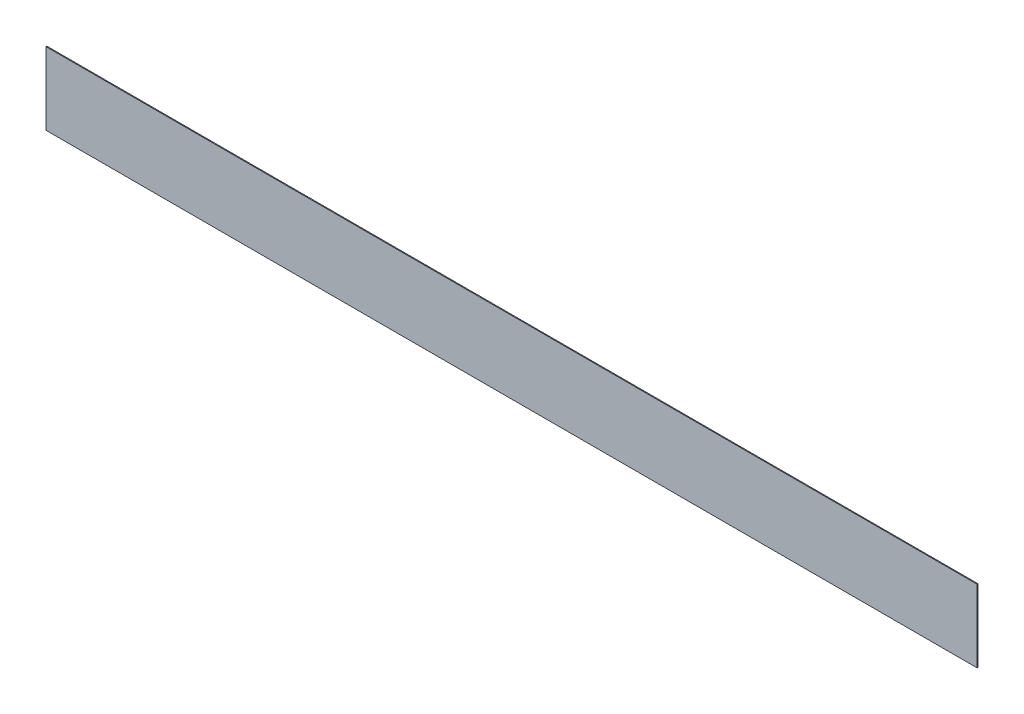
ISO-10303-21;
HEADER;
FILE_DESCRIPTION(('STEP AP214'),'2;1');
FILE_NAME('part.step','',(''),(''),'','','');
FILE_SCHEMA(('AUTOMOTIVE_DESIGN { 1 0 10303 214 1 1 1 1 }'));
ENDSEC;
DATA;
#1=APPLICATION_CONTEXT('core data for automotive mechanical design processes');
#2=APPLICATION_PROTOCOL_DEFINITION('international standard','automotive_design',2000,#1);
#3=PRODUCT_CONTEXT('',#1,'mechanical');
#4=PRODUCT('Part','Part','',(#3));
#5=PRODUCT_RELATED_PRODUCT_CATEGORY('part','',(#4));
#6=PRODUCT_DEFINITION_FORMATION('','',#4);
#7=PRODUCT_DEFINITION_CONTEXT('part definition',#1,'design');
#8=PRODUCT_DEFINITION('design','',#6,#7);
#9=PRODUCT_DEFINITION_SHAPE('','',#8);
#10=(LENGTH_UNIT() NAMED_UNIT(*) SI_UNIT(.MILLI.,.METRE.));
#11=(NAMED_UNIT(*) PLANE_ANGLE_UNIT() SI_UNIT($,.RADIAN.));
#12=(NAMED_UNIT(*) SI_UNIT($,.STERADIAN.) SOLID_ANGLE_UNIT());
#13=UNCERTAINTY_MEASURE_WITH_UNIT(LENGTH_MEASURE(1.E-05),#10,'distance_accuracy_value','');
#14=(GEOMETRIC_REPRESENTATION_CONTEXT(3) GLOBAL_UNCERTAINTY_ASSIGNED_CONTEXT((#13)) GLOBAL_UNIT_ASSIGNED_CONTEXT((#10,
#11,#12)) REPRESENTATION_CONTEXT('',''));
#15=CARTESIAN_POINT('',(0.,0.,0.));
#16=DIRECTION('',(0.,0.,1.));
#17=DIRECTION('',(1.,0.,0.));
#18=AXIS2_PLACEMENT_3D('',#15,#16,#17);
#19=CARTESIAN_POINT('',(-118.131068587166,38.8524363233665,2.));
#20=DIRECTION('',(1.,0.,0.));
#21=DIRECTION('',(0.,1.,0.));
#22=AXIS2_PLACEMENT_3D('',#19,#20,#21);
#23=PLANE('',#22);
#24=DIRECTION('',(0.,-1.,0.));
#25=VECTOR('',#24,1.);
#26=CARTESIAN_POINT('',(-118.131068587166,38.8524363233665,0.));
#27=LINE('',#26,#25);
#28=CARTESIAN_POINT('',(-118.131068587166,38.8524363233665,0.));
#29=VERTEX_POINT('',#28);
#30=CARTESIAN_POINT('',(-118.131068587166,-126.147563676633,0.));
#31=VERTEX_POINT('',#30);
#32=EDGE_CURVE('E95',#29,#31,#27,.T.);
#33=ORIENTED_EDGE('',*,*,#32,.T.);
#34=DIRECTION('',(0.,0.,-1.));
#35=VECTOR('',#34,1.);
#36=CARTESIAN_POINT('',(-118.131068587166,-126.147563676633,2.));
#37=LINE('',#36,#35);
#38=CARTESIAN_POINT('',(-118.131068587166,-126.147563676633,2.));
#39=VERTEX_POINT('',#38);
#40=EDGE_CURVE('E11',#39,#31,#37,.T.);
#41=ORIENTED_EDGE('',*,*,#40,.F.);
#42=DIRECTION('',(0.,-1.,0.));
#43=VECTOR('',#42,1.);
#44=CARTESIAN_POINT('',(-118.131068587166,38.8524363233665,2.));
#45=LINE('',#44,#43);
#46=CARTESIAN_POINT('',(-118.131068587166,38.8524363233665,2.));
#47=VERTEX_POINT('',#46);
#48=EDGE_CURVE('E83',#47,#39,#45,.T.);
#49=ORIENTED_EDGE('',*,*,#48,.F.);
#50=DIRECTION('',(0.,0.,-1.));
#51=VECTOR('',#50,1.);
#52=CARTESIAN_POINT('',(-118.131068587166,38.8524363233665,2.));
#53=LINE('',#52,#51);
#54=EDGE_CURVE('E91',#47,#29,#53,.T.);
#55=ORIENTED_EDGE('',*,*,#54,.T.);
#56=EDGE_LOOP('',(#33,#41,#49,#55));
#57=FACE_BOUND('',#56,.T.);
#58=ADVANCED_FACE('F32',(#57),#23,.F.);
#59=CARTESIAN_POINT('',(-118.131068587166,-126.147563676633,2.));
#60=DIRECTION('',(0.,1.,0.));
#61=DIRECTION('',(0.,0.,1.));
#62=AXIS2_PLACEMENT_3D('',#59,#60,#61);
#63=PLANE('',#62);
#64=DIRECTION('',(1.,0.,0.));
#65=VECTOR('',#64,1.);
#66=CARTESIAN_POINT('',(-118.131068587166,-126.147563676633,0.));
#67=LINE('',#66,#65);
#68=CARTESIAN_POINT('',(2001.86893141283,-126.147563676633,0.));
#69=VERTEX_POINT('',#68);
#70=EDGE_CURVE('E87',#31,#69,#67,.T.);
#71=ORIENTED_EDGE('',*,*,#70,.T.);
#72=DIRECTION('',(0.,0.,-1.));
#73=VECTOR('',#72,1.);
#74=CARTESIAN_POINT('',(2001.86893141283,-126.147563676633,2.));
#75=LINE('',#74,#73);
#76=CARTESIAN_POINT('',(2001.86893141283,-126.147563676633,2.));
#77=VERTEX_POINT('',#76);
#78=EDGE_CURVE('E40',#77,#69,#75,.T.);
#79=ORIENTED_EDGE('',*,*,#78,.F.);
#80=DIRECTION('',(1.,0.,0.));
#81=VECTOR('',#80,1.);
#82=CARTESIAN_POINT('',(-118.131068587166,-126.147563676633,2.));
#83=LINE('',#82,#81);
#84=EDGE_CURVE('E78',#39,#77,#83,.T.);
#85=ORIENTED_EDGE('',*,*,#84,.F.);
#86=ORIENTED_EDGE('',*,*,#40,.T.);
#87=EDGE_LOOP('',(#71,#79,#85,#86));
#88=FACE_BOUND('',#87,.T.);
#89=ADVANCED_FACE('F86',(#88),#63,.F.);
#90=CARTESIAN_POINT('',(2001.86893141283,38.8524363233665,2.));
#91=DIRECTION('',(-1.,0.,0.));
#92=DIRECTION('',(0.,0.,1.));
#93=AXIS2_PLACEMENT_3D('',#90,#91,#92);
#94=PLANE('',#93);
#95=DIRECTION('',(0.,1.,0.));
#96=VECTOR('',#95,1.);
#97=CARTESIAN_POINT('',(2001.86893141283,38.8524363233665,0.));
#98=LINE('',#97,#96);
#99=CARTESIAN_POINT('',(2001.86893141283,38.8524363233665,0.));
#100=VERTEX_POINT('',#99);
#101=EDGE_CURVE('E65',#69,#100,#98,.T.);
#102=ORIENTED_EDGE('',*,*,#101,.T.);
#103=DIRECTION('',(0.,0.,-1.));
#104=VECTOR('',#103,1.);
#105=CARTESIAN_POINT('',(2001.86893141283,38.8524363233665,2.));
#106=LINE('',#105,#104);
#107=CARTESIAN_POINT('',(2001.86893141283,38.8524363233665,2.));
#108=VERTEX_POINT('',#107);
#109=EDGE_CURVE('E88',#108,#100,#106,.T.);
#110=ORIENTED_EDGE('',*,*,#109,.F.);
#111=DIRECTION('',(0.,1.,0.));
#112=VECTOR('',#111,1.);
#113=CARTESIAN_POINT('',(2001.86893141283,38.8524363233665,2.));
#114=LINE('',#113,#112);
#115=EDGE_CURVE('E81',#77,#108,#114,.T.);
#116=ORIENTED_EDGE('',*,*,#115,.F.);
#117=ORIENTED_EDGE('',*,*,#78,.T.);
#118=EDGE_LOOP('',(#102,#110,#116,#117));
#119=FACE_BOUND('',#118,.T.);
#120=ADVANCED_FACE('F89',(#119),#94,.F.);
#121=CARTESIAN_POINT('',(-118.131068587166,38.8524363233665,2.));
#122=DIRECTION('',(0.,-1.,0.));
#123=DIRECTION('',(0.,0.,-1.));
#124=AXIS2_PLACEMENT_3D('',#121,#122,#123);
#125=PLANE('',#124);
#126=DIRECTION('',(-1.,0.,0.));
#127=VECTOR('',#126,1.);
#128=CARTESIAN_POINT('',(-118.131068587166,38.8524363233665,0.));
#129=LINE('',#128,#127);
#130=EDGE_CURVE('E71',#100,#29,#129,.T.);
#131=ORIENTED_EDGE('',*,*,#130,.T.);
#132=ORIENTED_EDGE('',*,*,#54,.F.);
#133=DIRECTION('',(-1.,0.,0.));
#134=VECTOR('',#133,1.);
#135=CARTESIAN_POINT('',(-118.131068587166,38.8524363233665,2.));
#136=LINE('',#135,#134);
#137=EDGE_CURVE('E48',#108,#47,#136,.T.);
#138=ORIENTED_EDGE('',*,*,#137,.F.);
#139=ORIENTED_EDGE('',*,*,#109,.T.);
#140=EDGE_LOOP('',(#131,#132,#138,#139));
#141=FACE_BOUND('',#140,.T.);
#142=ADVANCED_FACE('F102',(#141),#125,.F.);
#143=CARTESIAN_POINT('',(0.,0.,2.));
#144=DIRECTION('',(0.,0.,1.));
#145=DIRECTION('',(1.,0.,0.));
#146=AXIS2_PLACEMENT_3D('',#143,#144,#145);
#147=PLANE('',#146);
#148=ORIENTED_EDGE('',*,*,#48,.T.);
#149=ORIENTED_EDGE('',*,*,#84,.T.);
#150=ORIENTED_EDGE('',*,*,#115,.T.);
#151=ORIENTED_EDGE('',*,*,#137,.T.);
#152=EDGE_LOOP('',(#148,#149,#150,#151));
#153=FACE_BOUND('',#152,.T.);
#154=ADVANCED_FACE('F79',(#153),#147,.T.);
#155=CARTESIAN_POINT('',(0.,0.,0.));
#156=DIRECTION('',(0.,0.,1.));
#157=DIRECTION('',(1.,0.,0.));
#158=AXIS2_PLACEMENT_3D('',#155,#156,#157);
#159=PLANE('',#158);
#160=ORIENTED_EDGE('',*,*,#32,.F.);
#161=ORIENTED_EDGE('',*,*,#130,.F.);
#162=ORIENTED_EDGE('',*,*,#101,.F.);
#163=ORIENTED_EDGE('',*,*,#70,.F.);
#164=EDGE_LOOP('',(#160,#161,#162,#163));
#165=FACE_BOUND('',#164,.T.);
#166=ADVANCED_FACE('F105',(#165),#159,.F.);
#167=CLOSED_SHELL('',(#58,#89,#120,#142,#154,#166));
#168=MANIFOLD_SOLID_BREP('B2',#167);
#169=ADVANCED_BREP_SHAPE_REPRESENTATION('',(#18,#168),#14);
#170=SHAPE_DEFINITION_REPRESENTATION(#9,#169);
ENDSEC;
END-ISO-10303-21;
